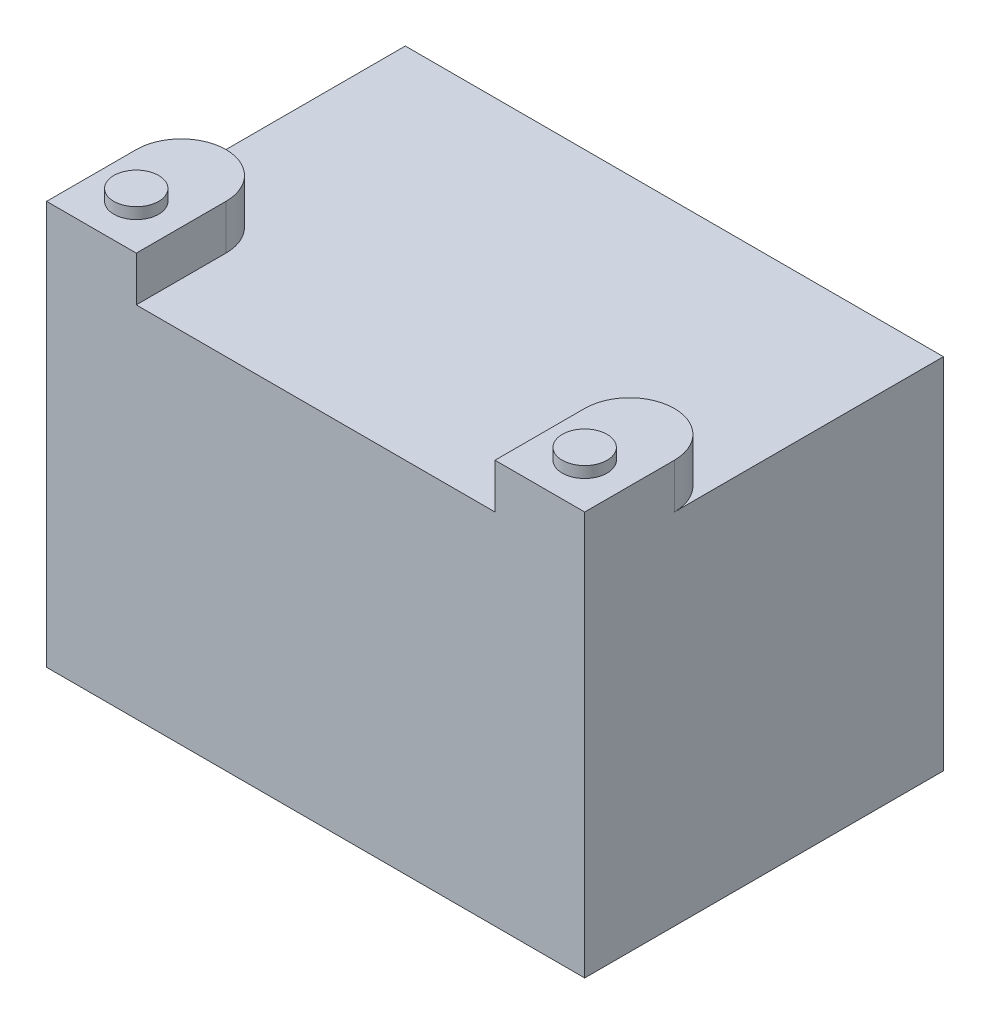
from build123d import *

# Parameters (mm, degrees)
SKETCH1_W           = 152.4
SKETCH1_H           = 101.6
BOSS_EXTRUDE1_DEPTH = 101.6
BOSS_EXTRUDE2_DEPTH = 12.7
SKETCH3_R           = 6.35
BOSS_EXTRUDE3_DEPTH = 3.175


with BuildPart() as part:
    # Sketch1 → Boss-Extrude1 (new body)
    with BuildSketch(Plane(origin=(0, 0, 0), x_dir=(1, 0, 0), z_dir=(0, 1, 0))):
        with Locations((76.2, 50.8)):
            Rectangle(SKETCH1_W, SKETCH1_H)
    extrude(amount=BOSS_EXTRUDE1_DEPTH)

    # Sketch2 → Boss-Extrude2 (add)
    with BuildSketch(Plane(origin=(0, 101.6, 0), x_dir=(1, 0, 0), z_dir=(0, 1, 0))):
        with BuildLine():
            Line((0, 0), (25.4, 0))
            Line((25.4, 0), (25.4, 25.4))
            ThreePointArc((25.4, 25.4), (12.7, 38.1), (0, 25.4))
            Line((0, 25.4), (0, 0))
        make_face()
        with BuildLine():
            Line((152.4, 0), (127, 0))
            Line((127, 0), (127, 25.4))
            ThreePointArc((127, 25.4), (139.70000099, 38.1), (152.4, 25.399998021))
            Line((152.4, 25.399998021), (152.4, 0))
        make_face()
    extrude(amount=BOSS_EXTRUDE2_DEPTH)

    # Sketch3 → Boss-Extrude3 (add)
    with BuildSketch(Plane(origin=(0, 114.3, 0), x_dir=(1, 0, 0), z_dir=(0, 1, 0))):
        with Locations(Location((12.7, 12.7, 0), (0, 0, 270))):
            Circle(SKETCH3_R)
        with Locations(Location((139.7, 12.7, 0), (0, 0, 90))):
            Circle(SKETCH3_R)
    extrude(amount=BOSS_EXTRUDE3_DEPTH)


solid = part.part
